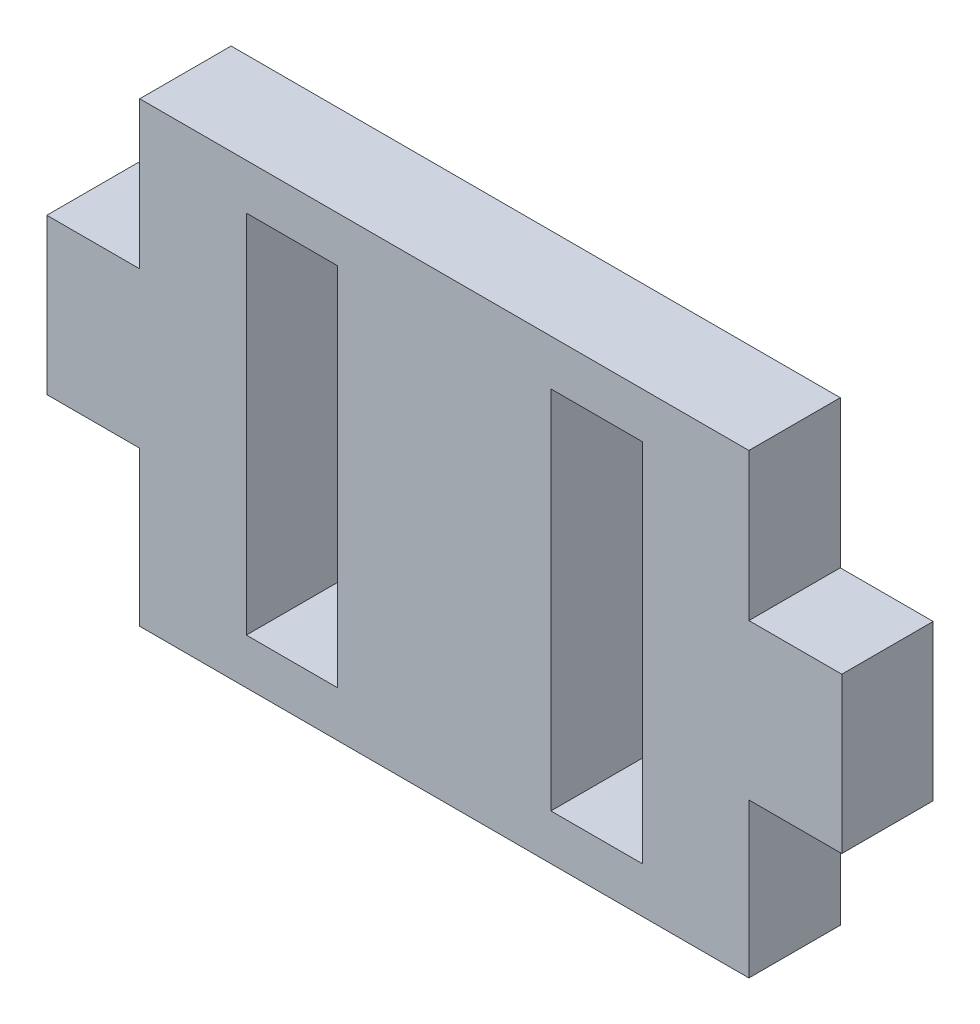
from build123d import *

# Parameters (mm, degrees)
SKETCH1_W           = 6
SKETCH1_H           = 24
BOSS_EXTRUDE1_DEPTH = 6


with BuildPart() as part:
    # Sketch1 → Boss-Extrude1 (new body)
    with BuildSketch(Plane.XY):
        Polygon((-5.909932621, 2.370202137), (-12.009932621, 2.370202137), (-12.009932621, -7.829797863), (-5.909932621, -7.829797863), (-5.909932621, -17.956015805), (34.090067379, -17.956015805), (34.090067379, -7.829797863), (40.190067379, -7.829797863), (40.190067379, 2.370202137), (34.090067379, 2.370202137), (34.090067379, 12.043984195), (-5.909932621, 12.043984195), align=None)
        with Locations((24.090067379, -2.956015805)):
            Rectangle(SKETCH1_W, SKETCH1_H, mode=Mode.SUBTRACT)
        with Locations((4.090067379, -2.956015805)):
            Rectangle(SKETCH1_W, SKETCH1_H, mode=Mode.SUBTRACT)
    extrude(amount=BOSS_EXTRUDE1_DEPTH)


solid = part.part
